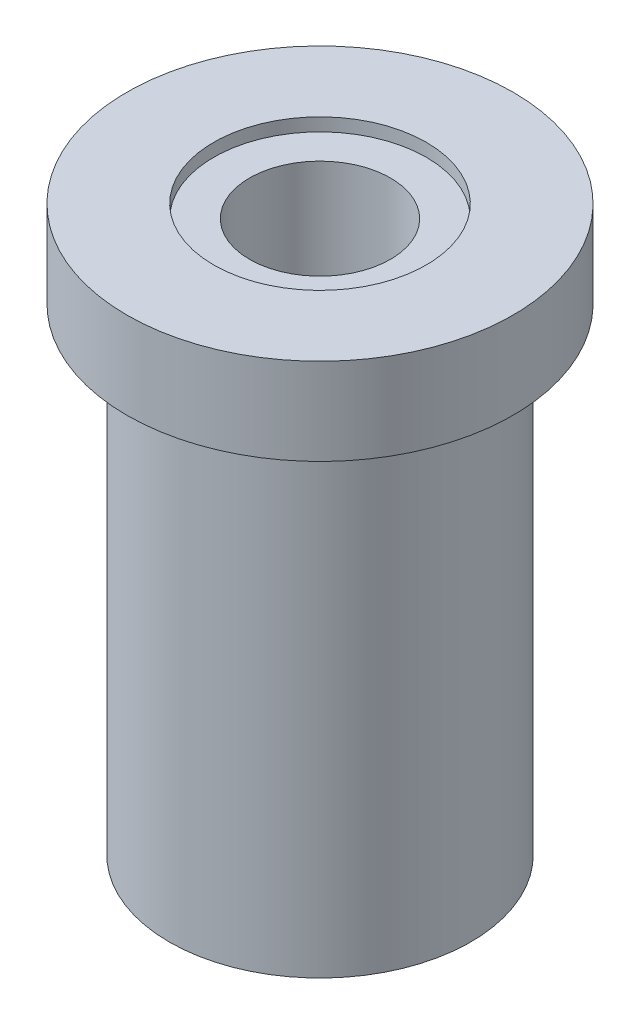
ISO-10303-21;
HEADER;
FILE_DESCRIPTION(('STEP AP214'),'2;1');
FILE_NAME('part.step','',(''),(''),'','','');
FILE_SCHEMA(('AUTOMOTIVE_DESIGN { 1 0 10303 214 1 1 1 1 }'));
ENDSEC;
DATA;
#1=APPLICATION_CONTEXT('core data for automotive mechanical design processes');
#2=APPLICATION_PROTOCOL_DEFINITION('international standard','automotive_design',2000,#1);
#3=PRODUCT_CONTEXT('',#1,'mechanical');
#4=PRODUCT('Part','Part','',(#3));
#5=PRODUCT_RELATED_PRODUCT_CATEGORY('part','',(#4));
#6=PRODUCT_DEFINITION_FORMATION('','',#4);
#7=PRODUCT_DEFINITION_CONTEXT('part definition',#1,'design');
#8=PRODUCT_DEFINITION('design','',#6,#7);
#9=PRODUCT_DEFINITION_SHAPE('','',#8);
#10=(LENGTH_UNIT() NAMED_UNIT(*) SI_UNIT(.MILLI.,.METRE.));
#11=(NAMED_UNIT(*) PLANE_ANGLE_UNIT() SI_UNIT($,.RADIAN.));
#12=(NAMED_UNIT(*) SI_UNIT($,.STERADIAN.) SOLID_ANGLE_UNIT());
#13=UNCERTAINTY_MEASURE_WITH_UNIT(LENGTH_MEASURE(1.E-05),#10,'distance_accuracy_value','');
#14=(GEOMETRIC_REPRESENTATION_CONTEXT(3) GLOBAL_UNCERTAINTY_ASSIGNED_CONTEXT((#13)) GLOBAL_UNIT_ASSIGNED_CONTEXT((#10,
#11,#12)) REPRESENTATION_CONTEXT('',''));
#15=CARTESIAN_POINT('',(0.,0.,0.));
#16=DIRECTION('',(0.,0.,1.));
#17=DIRECTION('',(1.,0.,0.));
#18=AXIS2_PLACEMENT_3D('',#15,#16,#17);
#19=CARTESIAN_POINT('',(0.,0.,0.));
#20=DIRECTION('',(0.,1.,0.));
#21=DIRECTION('',(0.,0.,1.));
#22=AXIS2_PLACEMENT_3D('',#19,#20,#21);
#23=CYLINDRICAL_SURFACE('',#22,3.25);
#24=CARTESIAN_POINT('',(0.,0.,0.));
#25=DIRECTION('',(0.,1.,0.));
#26=DIRECTION('',(0.,0.,1.));
#27=AXIS2_PLACEMENT_3D('',#24,#25,#26);
#28=CIRCLE('',#27,3.25);
#29=CARTESIAN_POINT('',(0.,0.,3.25));
#30=VERTEX_POINT('',#29);
#31=EDGE_CURVE('E52',#30,#30,#28,.T.);
#32=CARTESIAN_POINT('',(0.,25.4,0.));
#33=DIRECTION('',(0.,1.,0.));
#34=DIRECTION('',(0.,0.,1.));
#35=AXIS2_PLACEMENT_3D('',#32,#33,#34);
#36=CIRCLE('',#35,3.25);
#37=CARTESIAN_POINT('',(0.,25.4,3.25));
#38=VERTEX_POINT('',#37);
#39=EDGE_CURVE('E35',#38,#38,#36,.F.);
#40=CARTESIAN_POINT('',(0.,0.,3.25));
#41=CARTESIAN_POINT('',(0.,0.264583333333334,3.25));
#42=CARTESIAN_POINT('',(0.,0.529166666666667,3.25));
#43=CARTESIAN_POINT('',(0.,1.05833333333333,3.25));
#44=CARTESIAN_POINT('',(0.,1.32291666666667,3.25));
#45=CARTESIAN_POINT('',(0.,1.85208333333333,3.25));
#46=CARTESIAN_POINT('',(0.,2.11666666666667,3.25));
#47=CARTESIAN_POINT('',(0.,2.64583333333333,3.25));
#48=CARTESIAN_POINT('',(0.,2.91041666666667,3.25));
#49=CARTESIAN_POINT('',(0.,3.43958333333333,3.25));
#50=CARTESIAN_POINT('',(0.,3.70416666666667,3.25));
#51=CARTESIAN_POINT('',(0.,4.23333333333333,3.25));
#52=CARTESIAN_POINT('',(0.,4.49791666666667,3.25));
#53=CARTESIAN_POINT('',(0.,5.02708333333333,3.25));
#54=CARTESIAN_POINT('',(0.,5.29166666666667,3.25));
#55=CARTESIAN_POINT('',(0.,5.82083333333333,3.25));
#56=CARTESIAN_POINT('',(0.,6.08541666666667,3.25));
#57=CARTESIAN_POINT('',(0.,6.61458333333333,3.25));
#58=CARTESIAN_POINT('',(0.,6.87916666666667,3.25));
#59=CARTESIAN_POINT('',(0.,7.40833333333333,3.25));
#60=CARTESIAN_POINT('',(0.,7.67291666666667,3.25));
#61=CARTESIAN_POINT('',(0.,8.20208333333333,3.25));
#62=CARTESIAN_POINT('',(0.,8.46666666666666,3.25));
#63=CARTESIAN_POINT('',(0.,8.99583333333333,3.25));
#64=CARTESIAN_POINT('',(0.,9.26041666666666,3.25));
#65=CARTESIAN_POINT('',(0.,9.78958333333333,3.25));
#66=CARTESIAN_POINT('',(0.,10.0541666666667,3.25));
#67=CARTESIAN_POINT('',(0.,10.5833333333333,3.25));
#68=CARTESIAN_POINT('',(0.,10.8479166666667,3.25));
#69=CARTESIAN_POINT('',(0.,11.3770833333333,3.25));
#70=CARTESIAN_POINT('',(0.,11.6416666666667,3.25));
#71=CARTESIAN_POINT('',(0.,12.1708333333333,3.25));
#72=CARTESIAN_POINT('',(0.,12.4354166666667,3.25));
#73=CARTESIAN_POINT('',(0.,12.9645833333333,3.25));
#74=CARTESIAN_POINT('',(0.,13.2291666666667,3.25));
#75=CARTESIAN_POINT('',(0.,13.7583333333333,3.25));
#76=CARTESIAN_POINT('',(0.,14.0229166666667,3.25));
#77=CARTESIAN_POINT('',(0.,14.5520833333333,3.25));
#78=CARTESIAN_POINT('',(0.,14.8166666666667,3.25));
#79=CARTESIAN_POINT('',(0.,15.3458333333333,3.25));
#80=CARTESIAN_POINT('',(0.,15.6104166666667,3.25));
#81=CARTESIAN_POINT('',(0.,16.1395833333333,3.25));
#82=CARTESIAN_POINT('',(0.,16.4041666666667,3.25));
#83=CARTESIAN_POINT('',(0.,16.9333333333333,3.25));
#84=CARTESIAN_POINT('',(0.,17.1979166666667,3.25));
#85=CARTESIAN_POINT('',(0.,17.7270833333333,3.25));
#86=CARTESIAN_POINT('',(0.,17.9916666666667,3.25));
#87=CARTESIAN_POINT('',(0.,18.5208333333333,3.25));
#88=CARTESIAN_POINT('',(0.,18.7854166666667,3.25));
#89=CARTESIAN_POINT('',(0.,19.3145833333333,3.25));
#90=CARTESIAN_POINT('',(0.,19.5791666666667,3.25));
#91=CARTESIAN_POINT('',(0.,20.1083333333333,3.25));
#92=CARTESIAN_POINT('',(0.,20.3729166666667,3.25));
#93=CARTESIAN_POINT('',(0.,20.9020833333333,3.25));
#94=CARTESIAN_POINT('',(0.,21.1666666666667,3.25));
#95=CARTESIAN_POINT('',(0.,21.6958333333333,3.25));
#96=CARTESIAN_POINT('',(0.,21.9604166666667,3.25));
#97=CARTESIAN_POINT('',(0.,22.4895833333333,3.25));
#98=CARTESIAN_POINT('',(0.,22.7541666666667,3.25));
#99=CARTESIAN_POINT('',(0.,23.2833333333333,3.25));
#100=CARTESIAN_POINT('',(0.,23.5479166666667,3.25));
#101=CARTESIAN_POINT('',(0.,24.0770833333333,3.25));
#102=CARTESIAN_POINT('',(0.,24.3416666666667,3.25));
#103=CARTESIAN_POINT('',(0.,24.8708333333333,3.25));
#104=CARTESIAN_POINT('',(0.,25.1354166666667,3.25));
#105=CARTESIAN_POINT('',(0.,25.4,3.25));
#106=B_SPLINE_CURVE_WITH_KNOTS('',3,(#40,#41,#42,#43,#44,#45,#46,#47,#48,#49,#50,#51,#52,#53,
#54,#55,#56,#57,#58,#59,#60,#61,#62,#63,#64,#65,#66,#67,#68,#69,#70,#71,#72,#73,#74,#75,#76,#77,
#78,#79,#80,#81,#82,#83,#84,#85,#86,#87,#88,#89,#90,#91,#92,#93,#94,#95,#96,#97,#98,#99,#100,
#101,#102,#103,#104,#105),.UNSPECIFIED.,.F.,.F.,(4,2,2,2,2,2,2,2,2,2,2,2,2,2,2,2,2,2,2,2,2,2,2,
2,2,2,2,2,2,2,2,2,4),(0.,0.79375,1.5875,2.38125,3.175,3.96875,4.7625,5.55625,6.35,7.14375,
7.9375,8.73125,9.525,10.31875,11.1125,11.90625,12.7,13.49375,14.2875,15.08125,15.875,16.66875,
17.4625,18.25625,19.05,19.84375,20.6375,21.43125,22.225,23.01875,23.8125,24.60625,25.4),.UNSPECIFIED.);
#107=EDGE_CURVE('BSEAM31',#30,#38,#106,.T.);
#108=ORIENTED_EDGE('',*,*,#31,.F.);
#109=ORIENTED_EDGE('',*,*,#39,.F.);
#110=ORIENTED_EDGE('',*,*,#107,.T.);
#111=ORIENTED_EDGE('',*,*,#107,.F.);
#112=EDGE_LOOP('',(#108,#110,#109,#111));
#113=FACE_BOUND('',#112,.T.);
#114=ADVANCED_FACE('F31',(#113),#23,.F.);
#115=CARTESIAN_POINT('',(0.,22.,0.));
#116=DIRECTION('',(0.,-1.,0.));
#117=DIRECTION('',(0.,0.,-1.));
#118=AXIS2_PLACEMENT_3D('',#115,#116,#117);
#119=CYLINDRICAL_SURFACE('',#118,6.95);
#120=CARTESIAN_POINT('',(0.,21.7,0.));
#121=DIRECTION('',(0.,1.,0.));
#122=DIRECTION('',(0.,0.,1.));
#123=AXIS2_PLACEMENT_3D('',#120,#121,#122);
#124=CIRCLE('',#123,6.95);
#125=CARTESIAN_POINT('',(0.,21.7,6.95));
#126=VERTEX_POINT('',#125);
#127=EDGE_CURVE('E10',#126,#126,#124,.F.);
#128=ORIENTED_EDGE('',*,*,#127,.T.);
#129=EDGE_LOOP('',(#128));
#130=FACE_BOUND('',#129,.T.);
#131=CARTESIAN_POINT('',(0.,0.,0.));
#132=DIRECTION('',(0.,1.,0.));
#133=DIRECTION('',(0.,0.,1.));
#134=AXIS2_PLACEMENT_3D('',#131,#132,#133);
#135=CIRCLE('',#134,6.95);
#136=CARTESIAN_POINT('',(0.,0.,6.95));
#137=VERTEX_POINT('',#136);
#138=EDGE_CURVE('E43',#137,#137,#135,.T.);
#139=ORIENTED_EDGE('',*,*,#138,.T.);
#140=EDGE_LOOP('',(#139));
#141=FACE_BOUND('',#140,.T.);
#142=ADVANCED_FACE('F70',(#130,#141),#119,.T.);
#143=CARTESIAN_POINT('',(0.,0.,0.));
#144=DIRECTION('',(0.,1.,0.));
#145=DIRECTION('',(0.,0.,1.));
#146=AXIS2_PLACEMENT_3D('',#143,#144,#145);
#147=PLANE('',#146);
#148=ORIENTED_EDGE('',*,*,#31,.T.);
#149=EDGE_LOOP('',(#148));
#150=FACE_BOUND('',#149,.T.);
#151=ORIENTED_EDGE('',*,*,#138,.F.);
#152=EDGE_LOOP('',(#151));
#153=FACE_BOUND('',#152,.T.);
#154=ADVANCED_FACE('F78',(#150,#153),#147,.F.);
#155=CARTESIAN_POINT('',(0.,22.,0.));
#156=DIRECTION('',(0.,1.,0.));
#157=DIRECTION('',(0.,0.,1.));
#158=AXIS2_PLACEMENT_3D('',#155,#156,#157);
#159=PLANE('',#158);
#160=CARTESIAN_POINT('',(0.,22.,0.));
#161=DIRECTION('',(0.,1.,0.));
#162=DIRECTION('',(0.,0.,1.));
#163=AXIS2_PLACEMENT_3D('',#160,#161,#162);
#164=CIRCLE('',#163,7.25);
#165=CARTESIAN_POINT('',(0.,22.,7.25));
#166=VERTEX_POINT('',#165);
#167=EDGE_CURVE('E39',#166,#166,#164,.T.);
#168=ORIENTED_EDGE('',*,*,#167,.T.);
#169=EDGE_LOOP('',(#168));
#170=FACE_BOUND('',#169,.T.);
#171=CARTESIAN_POINT('',(0.,22.,0.));
#172=DIRECTION('',(0.,1.,0.));
#173=DIRECTION('',(0.,0.,1.));
#174=AXIS2_PLACEMENT_3D('',#171,#172,#173);
#175=CIRCLE('',#174,8.9);
#176=CARTESIAN_POINT('',(0.,22.,8.9));
#177=VERTEX_POINT('',#176);
#178=EDGE_CURVE('E49',#177,#177,#175,.T.);
#179=ORIENTED_EDGE('',*,*,#178,.F.);
#180=EDGE_LOOP('',(#179));
#181=FACE_BOUND('',#180,.T.);
#182=ADVANCED_FACE('F88',(#170,#181),#159,.F.);
#183=CARTESIAN_POINT('',(0.,26.,0.));
#184=DIRECTION('',(0.,-1.,0.));
#185=DIRECTION('',(0.,0.,-1.));
#186=AXIS2_PLACEMENT_3D('',#183,#184,#185);
#187=CYLINDRICAL_SURFACE('',#186,8.9);
#188=CARTESIAN_POINT('',(0.,26.,0.));
#189=DIRECTION('',(0.,1.,0.));
#190=DIRECTION('',(0.,0.,1.));
#191=AXIS2_PLACEMENT_3D('',#188,#189,#190);
#192=CIRCLE('',#191,8.9);
#193=CARTESIAN_POINT('',(0.,26.,8.9));
#194=VERTEX_POINT('',#193);
#195=EDGE_CURVE('E48',#194,#194,#192,.T.);
#196=ORIENTED_EDGE('',*,*,#195,.F.);
#197=EDGE_LOOP('',(#196));
#198=FACE_BOUND('',#197,.T.);
#199=ORIENTED_EDGE('',*,*,#178,.T.);
#200=EDGE_LOOP('',(#199));
#201=FACE_BOUND('',#200,.T.);
#202=ADVANCED_FACE('F86',(#198,#201),#187,.T.);
#203=CARTESIAN_POINT('',(0.,26.,0.));
#204=DIRECTION('',(0.,1.,0.));
#205=DIRECTION('',(0.,0.,1.));
#206=AXIS2_PLACEMENT_3D('',#203,#204,#205);
#207=PLANE('',#206);
#208=CARTESIAN_POINT('',(0.,26.,0.));
#209=DIRECTION('',(0.,1.,0.));
#210=DIRECTION('',(0.,0.,1.));
#211=AXIS2_PLACEMENT_3D('',#208,#209,#210);
#212=CIRCLE('',#211,4.9);
#213=CARTESIAN_POINT('',(0.,26.,4.9));
#214=VERTEX_POINT('',#213);
#215=EDGE_CURVE('E57',#214,#214,#212,.T.);
#216=ORIENTED_EDGE('',*,*,#215,.F.);
#217=EDGE_LOOP('',(#216));
#218=FACE_BOUND('',#217,.T.);
#219=ORIENTED_EDGE('',*,*,#195,.T.);
#220=EDGE_LOOP('',(#219));
#221=FACE_BOUND('',#220,.T.);
#222=ADVANCED_FACE('F84',(#218,#221),#207,.T.);
#223=CARTESIAN_POINT('',(0.,21.7,0.));
#224=DIRECTION('',(0.,1.,0.));
#225=DIRECTION('',(0.,0.,1.));
#226=AXIS2_PLACEMENT_3D('',#223,#224,#225);
#227=TOROIDAL_SURFACE('',#226,7.25,0.3);
#228=ORIENTED_EDGE('',*,*,#127,.F.);
#229=EDGE_LOOP('',(#228));
#230=FACE_BOUND('',#229,.T.);
#231=ORIENTED_EDGE('',*,*,#167,.F.);
#232=EDGE_LOOP('',(#231));
#233=FACE_BOUND('',#232,.T.);
#234=ADVANCED_FACE('F33',(#230,#233),#227,.F.);
#235=CARTESIAN_POINT('',(0.,25.4,0.));
#236=DIRECTION('',(0.,1.,0.));
#237=DIRECTION('',(0.,0.,1.));
#238=AXIS2_PLACEMENT_3D('',#235,#236,#237);
#239=PLANE('',#238);
#240=CARTESIAN_POINT('',(0.,25.4,0.));
#241=DIRECTION('',(0.,1.,0.));
#242=DIRECTION('',(0.,0.,1.));
#243=AXIS2_PLACEMENT_3D('',#240,#241,#242);
#244=CIRCLE('',#243,4.9);
#245=CARTESIAN_POINT('',(0.,25.4,4.9));
#246=VERTEX_POINT('',#245);
#247=EDGE_CURVE('E60',#246,#246,#244,.T.);
#248=ORIENTED_EDGE('',*,*,#247,.T.);
#249=EDGE_LOOP('',(#248));
#250=FACE_BOUND('',#249,.T.);
#251=ORIENTED_EDGE('',*,*,#39,.T.);
#252=EDGE_LOOP('',(#251));
#253=FACE_BOUND('',#252,.T.);
#254=ADVANCED_FACE('F67',(#250,#253),#239,.T.);
#255=CARTESIAN_POINT('',(0.,25.4,0.));
#256=DIRECTION('',(0.,1.,0.));
#257=DIRECTION('',(0.,0.,1.));
#258=AXIS2_PLACEMENT_3D('',#255,#256,#257);
#259=CYLINDRICAL_SURFACE('',#258,4.9);
#260=ORIENTED_EDGE('',*,*,#247,.F.);
#261=EDGE_LOOP('',(#260));
#262=FACE_BOUND('',#261,.T.);
#263=ORIENTED_EDGE('',*,*,#215,.T.);
#264=EDGE_LOOP('',(#263));
#265=FACE_BOUND('',#264,.T.);
#266=ADVANCED_FACE('F82',(#262,#265),#259,.F.);
#267=CLOSED_SHELL('',(#114,#142,#154,#182,#202,#222,#234,#254,#266));
#268=MANIFOLD_SOLID_BREP('B2',#267);
#269=ADVANCED_BREP_SHAPE_REPRESENTATION('',(#18,#268),#14);
#270=SHAPE_DEFINITION_REPRESENTATION(#9,#269);
ENDSEC;
END-ISO-10303-21;
